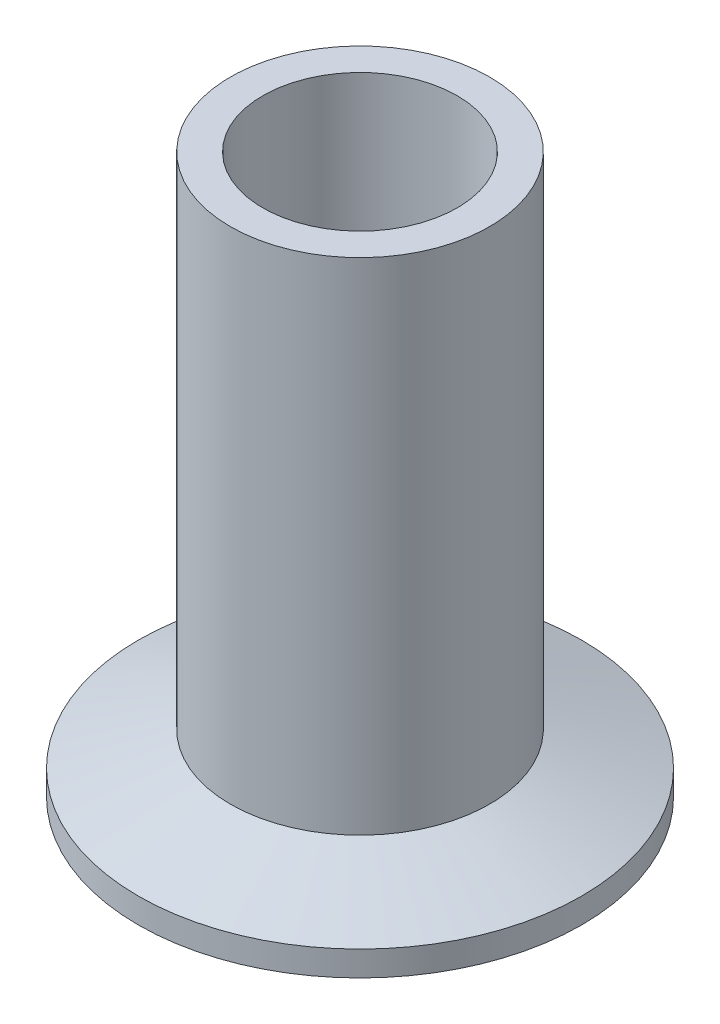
ISO-10303-21;
HEADER;
FILE_DESCRIPTION(('STEP AP214'),'2;1');
FILE_NAME('part.step','',(''),(''),'','','');
FILE_SCHEMA(('AUTOMOTIVE_DESIGN { 1 0 10303 214 1 1 1 1 }'));
ENDSEC;
DATA;
#1=APPLICATION_CONTEXT('core data for automotive mechanical design processes');
#2=APPLICATION_PROTOCOL_DEFINITION('international standard','automotive_design',2000,#1);
#3=PRODUCT_CONTEXT('',#1,'mechanical');
#4=PRODUCT('Part','Part','',(#3));
#5=PRODUCT_RELATED_PRODUCT_CATEGORY('part','',(#4));
#6=PRODUCT_DEFINITION_FORMATION('','',#4);
#7=PRODUCT_DEFINITION_CONTEXT('part definition',#1,'design');
#8=PRODUCT_DEFINITION('design','',#6,#7);
#9=PRODUCT_DEFINITION_SHAPE('','',#8);
#10=(LENGTH_UNIT() NAMED_UNIT(*) SI_UNIT(.MILLI.,.METRE.));
#11=(NAMED_UNIT(*) PLANE_ANGLE_UNIT() SI_UNIT($,.RADIAN.));
#12=(NAMED_UNIT(*) SI_UNIT($,.STERADIAN.) SOLID_ANGLE_UNIT());
#13=UNCERTAINTY_MEASURE_WITH_UNIT(LENGTH_MEASURE(1.E-05),#10,'distance_accuracy_value','');
#14=(GEOMETRIC_REPRESENTATION_CONTEXT(3) GLOBAL_UNCERTAINTY_ASSIGNED_CONTEXT((#13)) GLOBAL_UNIT_ASSIGNED_CONTEXT((#10,
#11,#12)) REPRESENTATION_CONTEXT('',''));
#15=CARTESIAN_POINT('',(0.,0.,0.));
#16=DIRECTION('',(0.,0.,1.));
#17=DIRECTION('',(1.,0.,0.));
#18=AXIS2_PLACEMENT_3D('',#15,#16,#17);
#19=CARTESIAN_POINT('',(0.,0.,0.));
#20=DIRECTION('',(0.,1.,0.));
#21=DIRECTION('',(0.,0.,1.));
#22=AXIS2_PLACEMENT_3D('',#19,#20,#21);
#23=PLANE('',#22);
#24=CARTESIAN_POINT('',(0.,0.,0.));
#25=DIRECTION('',(0.,-1.,0.));
#26=DIRECTION('',(0.,0.,-1.));
#27=AXIS2_PLACEMENT_3D('',#24,#25,#26);
#28=CIRCLE('',#27,23.6441393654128);
#29=CARTESIAN_POINT('',(0.,0.,-23.6441393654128));
#30=VERTEX_POINT('',#29);
#31=EDGE_CURVE('E10',#30,#30,#28,.T.);
#32=ORIENTED_EDGE('',*,*,#31,.F.);
#33=EDGE_LOOP('',(#32));
#34=FACE_BOUND('',#33,.T.);
#35=CARTESIAN_POINT('',(0.,0.,0.));
#36=DIRECTION('',(0.,-1.,0.));
#37=DIRECTION('',(0.,0.,-1.));
#38=AXIS2_PLACEMENT_3D('',#35,#36,#37);
#39=CIRCLE('',#38,25.1968);
#40=CARTESIAN_POINT('',(0.,0.,-25.1968));
#41=VERTEX_POINT('',#40);
#42=EDGE_CURVE('E73',#41,#41,#39,.T.);
#43=ORIENTED_EDGE('',*,*,#42,.T.);
#44=EDGE_LOOP('',(#43));
#45=FACE_BOUND('',#44,.T.);
#46=ADVANCED_FACE('F33',(#34,#45),#23,.F.);
#47=CARTESIAN_POINT('',(0.,0.508,0.));
#48=DIRECTION('',(0.,-1.,0.));
#49=DIRECTION('',(0.,0.,-1.));
#50=AXIS2_PLACEMENT_3D('',#47,#48,#49);
#51=TOROIDAL_SURFACE('',#50,23.6441393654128,0.508);
#52=CARTESIAN_POINT('',(0.,0.285307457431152,0.));
#53=DIRECTION('',(0.,-1.,0.));
#54=DIRECTION('',(0.,0.,-1.));
#55=AXIS2_PLACEMENT_3D('',#52,#53,#54);
#56=CIRCLE('',#55,23.1875519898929);
#57=CARTESIAN_POINT('',(0.,0.285307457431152,-23.1875519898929));
#58=VERTEX_POINT('',#57);
#59=EDGE_CURVE('E39',#58,#58,#56,.T.);
#60=ORIENTED_EDGE('',*,*,#59,.F.);
#61=EDGE_LOOP('',(#60));
#62=FACE_BOUND('',#61,.T.);
#63=ORIENTED_EDGE('',*,*,#31,.T.);
#64=EDGE_LOOP('',(#63));
#65=FACE_BOUND('',#64,.T.);
#66=ADVANCED_FACE('F114',(#62,#65),#51,.T.);
#67=CARTESIAN_POINT('',(0.,0.744846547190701,0.));
#68=DIRECTION('',(0.,-1.,0.));
#69=DIRECTION('',(0.,0.,-1.));
#70=AXIS2_PLACEMENT_3D('',#67,#68,#69);
#71=CONICAL_SURFACE('',#70,22.9634198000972,0.453785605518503);
#72=ORIENTED_EDGE('',*,*,#59,.T.);
#73=EDGE_LOOP('',(#72));
#74=FACE_BOUND('',#73,.T.);
#75=CARTESIAN_POINT('',(0.,0.744846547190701,0.));
#76=DIRECTION('',(0.,-1.,0.));
#77=DIRECTION('',(0.,0.,-1.));
#78=AXIS2_PLACEMENT_3D('',#75,#76,#77);
#79=CIRCLE('',#78,22.9634198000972);
#80=CARTESIAN_POINT('',(0.,0.744846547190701,-22.9634198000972));
#81=VERTEX_POINT('',#80);
#82=EDGE_CURVE('E43',#81,#81,#79,.T.);
#83=ORIENTED_EDGE('',*,*,#82,.F.);
#84=EDGE_LOOP('',(#83));
#85=FACE_BOUND('',#84,.T.);
#86=ADVANCED_FACE('F119',(#74,#85),#71,.F.);
#87=CARTESIAN_POINT('',(0.,0.4064,0.));
#88=DIRECTION('',(0.,-1.,0.));
#89=DIRECTION('',(0.,0.,-1.));
#90=AXIS2_PLACEMENT_3D('',#87,#88,#89);
#91=TOROIDAL_SURFACE('',#90,21.8186,1.1938);
#92=ORIENTED_EDGE('',*,*,#82,.T.);
#93=EDGE_LOOP('',(#92));
#94=FACE_BOUND('',#93,.T.);
#95=CARTESIAN_POINT('',(0.,0.814703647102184,0.));
#96=DIRECTION('',(0.,-1.,0.));
#97=DIRECTION('',(0.,0.,-1.));
#98=AXIS2_PLACEMENT_3D('',#95,#96,#97);
#99=CIRCLE('',#98,20.6967949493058);
#100=CARTESIAN_POINT('',(0.,0.814703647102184,-20.6967949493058));
#101=VERTEX_POINT('',#100);
#102=EDGE_CURVE('E47',#101,#101,#99,.T.);
#103=ORIENTED_EDGE('',*,*,#102,.F.);
#104=EDGE_LOOP('',(#103));
#105=FACE_BOUND('',#104,.T.);
#106=ADVANCED_FACE('F124',(#94,#105),#91,.F.);
#107=CARTESIAN_POINT('',(0.,0.334253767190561,0.));
#108=DIRECTION('',(0.,1.,0.));
#109=DIRECTION('',(0.,0.,1.));
#110=AXIS2_PLACEMENT_3D('',#107,#108,#109);
#111=CONICAL_SURFACE('',#110,20.5219254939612,0.349065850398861);
#112=ORIENTED_EDGE('',*,*,#102,.T.);
#113=EDGE_LOOP('',(#112));
#114=FACE_BOUND('',#113,.T.);
#115=CARTESIAN_POINT('',(0.,0.334253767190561,0.));
#116=DIRECTION('',(0.,-1.,0.));
#117=DIRECTION('',(0.,0.,-1.));
#118=AXIS2_PLACEMENT_3D('',#115,#116,#117);
#119=CIRCLE('',#118,20.5219254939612);
#120=CARTESIAN_POINT('',(0.,0.334253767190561,-20.5219254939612));
#121=VERTEX_POINT('',#120);
#122=EDGE_CURVE('E52',#121,#121,#119,.T.);
#123=ORIENTED_EDGE('',*,*,#122,.F.);
#124=EDGE_LOOP('',(#123));
#125=FACE_BOUND('',#124,.T.);
#126=ADVANCED_FACE('F129',(#114,#125),#111,.T.);
#127=CARTESIAN_POINT('',(0.,0.508,0.));
#128=DIRECTION('',(0.,-1.,0.));
#129=DIRECTION('',(0.,0.,-1.));
#130=AXIS2_PLACEMENT_3D('',#127,#128,#129);
#131=TOROIDAL_SURFACE('',#130,20.0445616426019,0.508);
#132=ORIENTED_EDGE('',*,*,#122,.T.);
#133=EDGE_LOOP('',(#132));
#134=FACE_BOUND('',#133,.T.);
#135=CARTESIAN_POINT('',(0.,0.,0.));
#136=DIRECTION('',(0.,-1.,0.));
#137=DIRECTION('',(0.,0.,-1.));
#138=AXIS2_PLACEMENT_3D('',#135,#136,#137);
#139=CIRCLE('',#138,20.0445616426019);
#140=CARTESIAN_POINT('',(0.,0.,-20.0445616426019));
#141=VERTEX_POINT('',#140);
#142=EDGE_CURVE('E55',#141,#141,#139,.T.);
#143=ORIENTED_EDGE('',*,*,#142,.F.);
#144=EDGE_LOOP('',(#143));
#145=FACE_BOUND('',#144,.T.);
#146=ADVANCED_FACE('F110',(#134,#145),#131,.T.);
#147=CARTESIAN_POINT('',(0.,0.,0.));
#148=DIRECTION('',(0.,1.,0.));
#149=DIRECTION('',(0.,0.,1.));
#150=AXIS2_PLACEMENT_3D('',#147,#148,#149);
#151=PLANE('',#150);
#152=CARTESIAN_POINT('',(0.,0.,0.));
#153=DIRECTION('',(0.,-1.,0.));
#154=DIRECTION('',(0.,0.,-1.));
#155=AXIS2_PLACEMENT_3D('',#152,#153,#154);
#156=CIRCLE('',#155,11.049);
#157=CARTESIAN_POINT('',(0.,0.,-11.049));
#158=VERTEX_POINT('',#157);
#159=EDGE_CURVE('E58',#158,#158,#156,.T.);
#160=ORIENTED_EDGE('',*,*,#159,.F.);
#161=EDGE_LOOP('',(#160));
#162=FACE_BOUND('',#161,.T.);
#163=ORIENTED_EDGE('',*,*,#142,.T.);
#164=EDGE_LOOP('',(#163));
#165=FACE_BOUND('',#164,.T.);
#166=ADVANCED_FACE('F104',(#162,#165),#151,.F.);
#167=CARTESIAN_POINT('',(0.,0.,0.));
#168=DIRECTION('',(0.,-1.,0.));
#169=DIRECTION('',(0.,0.,-1.));
#170=AXIS2_PLACEMENT_3D('',#167,#168,#169);
#171=CYLINDRICAL_SURFACE('',#170,11.049);
#172=ORIENTED_EDGE('',*,*,#159,.T.);
#173=EDGE_LOOP('',(#172));
#174=FACE_BOUND('',#173,.T.);
#175=CARTESIAN_POINT('',(0.,63.5,0.));
#176=DIRECTION('',(0.,-1.,0.));
#177=DIRECTION('',(0.,0.,-1.));
#178=AXIS2_PLACEMENT_3D('',#175,#176,#177);
#179=CIRCLE('',#178,11.049);
#180=CARTESIAN_POINT('',(0.,63.5,-11.049));
#181=VERTEX_POINT('',#180);
#182=EDGE_CURVE('E61',#181,#181,#179,.T.);
#183=ORIENTED_EDGE('',*,*,#182,.F.);
#184=EDGE_LOOP('',(#183));
#185=FACE_BOUND('',#184,.T.);
#186=ADVANCED_FACE('F99',(#174,#185),#171,.F.);
#187=CARTESIAN_POINT('',(0.,63.5,0.));
#188=DIRECTION('',(0.,-1.,0.));
#189=DIRECTION('',(0.,0.,-1.));
#190=AXIS2_PLACEMENT_3D('',#187,#188,#189);
#191=PLANE('',#190);
#192=CARTESIAN_POINT('',(0.,63.5,0.));
#193=DIRECTION('',(0.,-1.,0.));
#194=DIRECTION('',(0.,0.,-1.));
#195=AXIS2_PLACEMENT_3D('',#192,#193,#194);
#196=CIRCLE('',#195,14.732);
#197=CARTESIAN_POINT('',(0.,63.5,-14.732));
#198=VERTEX_POINT('',#197);
#199=EDGE_CURVE('E64',#198,#198,#196,.T.);
#200=ORIENTED_EDGE('',*,*,#199,.F.);
#201=EDGE_LOOP('',(#200));
#202=FACE_BOUND('',#201,.T.);
#203=ORIENTED_EDGE('',*,*,#182,.T.);
#204=EDGE_LOOP('',(#203));
#205=FACE_BOUND('',#204,.T.);
#206=ADVANCED_FACE('F93',(#202,#205),#191,.F.);
#207=CARTESIAN_POINT('',(0.,0.,0.));
#208=DIRECTION('',(0.,-1.,0.));
#209=DIRECTION('',(0.,0.,-1.));
#210=AXIS2_PLACEMENT_3D('',#207,#208,#209);
#211=CYLINDRICAL_SURFACE('',#210,14.732);
#212=CARTESIAN_POINT('',(0.,6.65367570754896,0.));
#213=DIRECTION('',(0.,-1.,0.));
#214=DIRECTION('',(0.,0.,-1.));
#215=AXIS2_PLACEMENT_3D('',#212,#213,#214);
#216=CIRCLE('',#215,14.732);
#217=CARTESIAN_POINT('',(0.,6.65367570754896,-14.732));
#218=VERTEX_POINT('',#217);
#219=EDGE_CURVE('E67',#218,#218,#216,.T.);
#220=ORIENTED_EDGE('',*,*,#219,.F.);
#221=EDGE_LOOP('',(#220));
#222=FACE_BOUND('',#221,.T.);
#223=ORIENTED_EDGE('',*,*,#199,.T.);
#224=EDGE_LOOP('',(#223));
#225=FACE_BOUND('',#224,.T.);
#226=ADVANCED_FACE('F87',(#222,#225),#211,.T.);
#227=CARTESIAN_POINT('',(0.,6.65367570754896,0.));
#228=DIRECTION('',(0.,-1.,0.));
#229=DIRECTION('',(0.,0.,-1.));
#230=AXIS2_PLACEMENT_3D('',#227,#228,#229);
#231=CONICAL_SURFACE('',#230,14.732,1.22173047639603);
#232=CARTESIAN_POINT('',(0.,2.8448,0.));
#233=DIRECTION('',(0.,-1.,0.));
#234=DIRECTION('',(0.,0.,-1.));
#235=AXIS2_PLACEMENT_3D('',#232,#233,#234);
#236=CIRCLE('',#235,25.1968);
#237=CARTESIAN_POINT('',(0.,2.8448,-25.1968));
#238=VERTEX_POINT('',#237);
#239=EDGE_CURVE('E70',#238,#238,#236,.T.);
#240=ORIENTED_EDGE('',*,*,#239,.F.);
#241=EDGE_LOOP('',(#240));
#242=FACE_BOUND('',#241,.T.);
#243=ORIENTED_EDGE('',*,*,#219,.T.);
#244=EDGE_LOOP('',(#243));
#245=FACE_BOUND('',#244,.T.);
#246=ADVANCED_FACE('F81',(#242,#245),#231,.T.);
#247=CARTESIAN_POINT('',(0.,0.,0.));
#248=DIRECTION('',(0.,-1.,0.));
#249=DIRECTION('',(0.,0.,-1.));
#250=AXIS2_PLACEMENT_3D('',#247,#248,#249);
#251=CYLINDRICAL_SURFACE('',#250,25.1968);
#252=ORIENTED_EDGE('',*,*,#42,.F.);
#253=EDGE_LOOP('',(#252));
#254=FACE_BOUND('',#253,.T.);
#255=ORIENTED_EDGE('',*,*,#239,.T.);
#256=EDGE_LOOP('',(#255));
#257=FACE_BOUND('',#256,.T.);
#258=ADVANCED_FACE('F78',(#254,#257),#251,.T.);
#259=CLOSED_SHELL('',(#46,#66,#86,#106,#126,#146,#166,#186,#206,#226,#246,#258));
#260=MANIFOLD_SOLID_BREP('B2',#259);
#261=ADVANCED_BREP_SHAPE_REPRESENTATION('',(#18,#260),#14);
#262=SHAPE_DEFINITION_REPRESENTATION(#9,#261);
ENDSEC;
END-ISO-10303-21;
